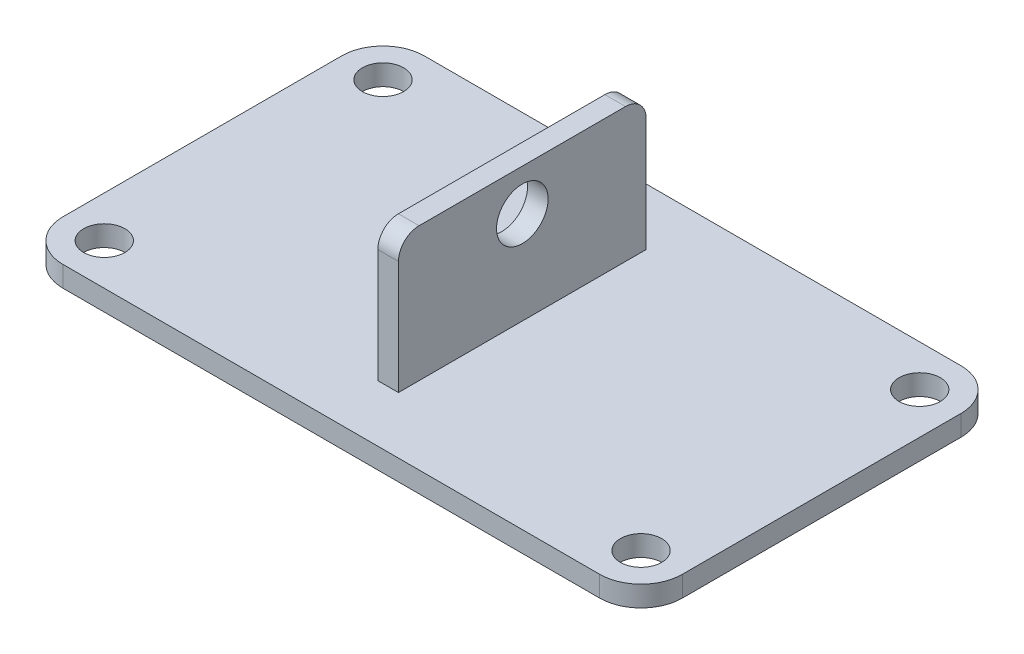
from build123d import *

# Parameters (mm, degrees)
SKETCH1_R           = 10
BOSS_EXTRUDE1_DEPTH = 10
SKETCH2_R           = 12.5
BOSS_EXTRUDE3_DEPTH = 5


with BuildPart() as part:
    # Sketch1 → Boss-Extrude1 (new body)
    with BuildSketch(Plane(origin=(0, 0, 0), x_dir=(1, 0, 0), z_dir=(0, 1, 0))):
        with BuildLine():
            Line((-130, -87.5), (130, -87.5))
            ThreePointArc((130, -87.5), (144.142135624, -81.642135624), (150, -67.5))
            Line((150, -67.5), (150, 67.5))
            ThreePointArc((150, 67.5), (144.142135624, 81.642135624), (130, 87.5))
            Line((130, 87.5), (-130, 87.5))
            ThreePointArc((-130, 87.5), (-144.142135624, 81.642135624), (-150, 67.5))
            Line((-150, 67.5), (-150, -67.5))
            ThreePointArc((-150, -67.5), (-144.142135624, -81.642135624), (-130, -87.5))
        make_face()
        with Locations(Location((130, 67.5, 0), (0, 0, 270))):
            Circle(SKETCH1_R, mode=Mode.SUBTRACT)
        with Locations(Location((130, -67.5, 0), (0, 0, 270))):
            Circle(SKETCH1_R, mode=Mode.SUBTRACT)
        with Locations(Location((-130, 67.5, 0), (0, 0, 270))):
            Circle(SKETCH1_R, mode=Mode.SUBTRACT)
        with Locations(Location((-130, -67.5, 0), (0, 0, 270))):
            Circle(SKETCH1_R, mode=Mode.SUBTRACT)
    extrude(amount=BOSS_EXTRUDE1_DEPTH)

    # Sketch2 → Boss-Extrude3 (add, symmetric)
    with BuildSketch(Plane(origin=(0, 0, 0), x_dir=(0, 0, -1), z_dir=(1, 0, 0))):
        with BuildLine():
            Line((-60, 10), (60, 10))
            Line((60, 10), (60, 65))
            ThreePointArc((60, 65), (57.071067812, 72.071067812), (50, 75))
            Line((50, 75), (-50, 75))
            ThreePointArc((-50, 75), (-57.071067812, 72.071067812), (-60, 65))
            Line((-60, 65), (-60, 10))
        make_face()
        with Locations((0, 55)):
            Circle(SKETCH2_R, mode=Mode.SUBTRACT)
    extrude(amount=BOSS_EXTRUDE3_DEPTH, both=True)


solid = part.part
